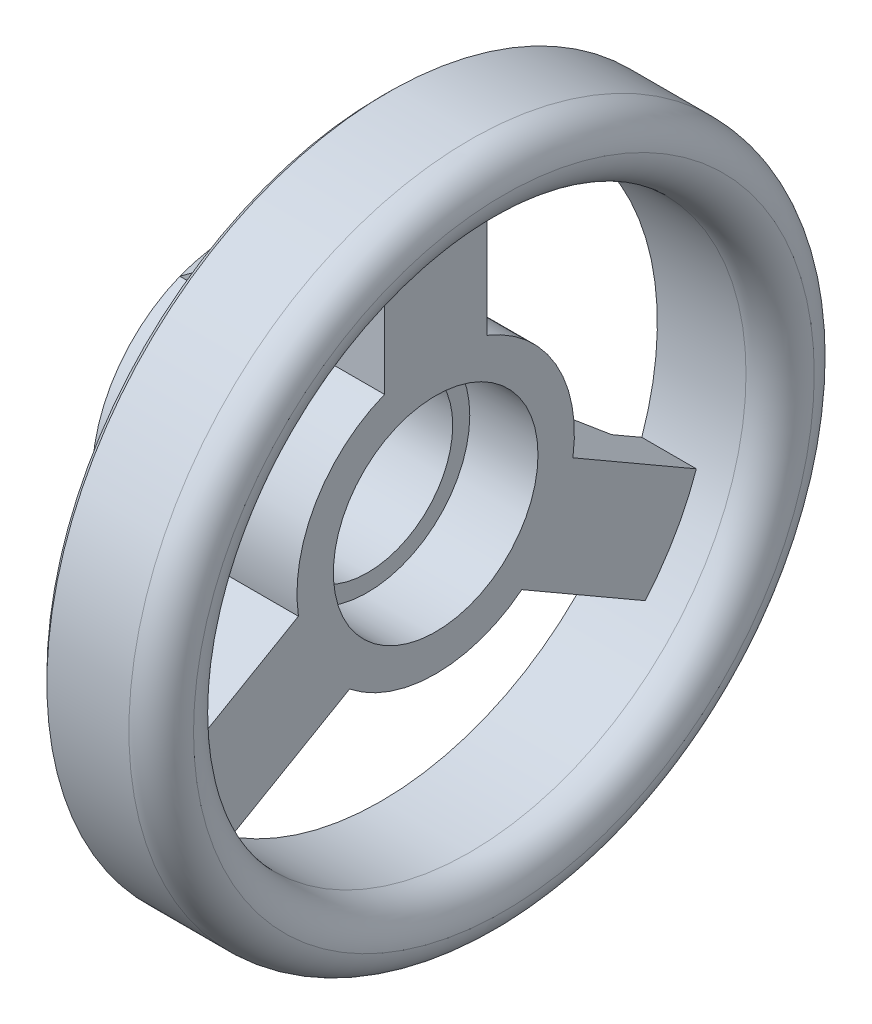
ISO-10303-21;
HEADER;
FILE_DESCRIPTION(('STEP AP214'),'2;1');
FILE_NAME('part.step','',(''),(''),'','','');
FILE_SCHEMA(('AUTOMOTIVE_DESIGN { 1 0 10303 214 1 1 1 1 }'));
ENDSEC;
DATA;
#1=APPLICATION_CONTEXT('core data for automotive mechanical design processes');
#2=APPLICATION_PROTOCOL_DEFINITION('international standard','automotive_design',2000,#1);
#3=PRODUCT_CONTEXT('',#1,'mechanical');
#4=PRODUCT('Part','Part','',(#3));
#5=PRODUCT_RELATED_PRODUCT_CATEGORY('part','',(#4));
#6=PRODUCT_DEFINITION_FORMATION('','',#4);
#7=PRODUCT_DEFINITION_CONTEXT('part definition',#1,'design');
#8=PRODUCT_DEFINITION('design','',#6,#7);
#9=PRODUCT_DEFINITION_SHAPE('','',#8);
#10=(LENGTH_UNIT() NAMED_UNIT(*) SI_UNIT(.MILLI.,.METRE.));
#11=(NAMED_UNIT(*) PLANE_ANGLE_UNIT() SI_UNIT($,.RADIAN.));
#12=(NAMED_UNIT(*) SI_UNIT($,.STERADIAN.) SOLID_ANGLE_UNIT());
#13=UNCERTAINTY_MEASURE_WITH_UNIT(LENGTH_MEASURE(1.E-05),#10,'distance_accuracy_value','');
#14=(GEOMETRIC_REPRESENTATION_CONTEXT(3) GLOBAL_UNCERTAINTY_ASSIGNED_CONTEXT((#13)) GLOBAL_UNIT_ASSIGNED_CONTEXT((#10,
#11,#12)) REPRESENTATION_CONTEXT('',''));
#15=CARTESIAN_POINT('',(0.,0.,0.));
#16=DIRECTION('',(0.,0.,1.));
#17=DIRECTION('',(1.,0.,0.));
#18=AXIS2_PLACEMENT_3D('',#15,#16,#17);
#19=CARTESIAN_POINT('',(2.2,0.,0.));
#20=DIRECTION('',(1.,0.,0.));
#21=DIRECTION('',(0.,0.,-1.));
#22=AXIS2_PLACEMENT_3D('',#19,#20,#21);
#23=CONICAL_SURFACE('',#22,3.55,0.603457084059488);
#24=CARTESIAN_POINT('',(0.,0.,0.));
#25=DIRECTION('',(-1.,0.,0.));
#26=DIRECTION('',(0.,0.,1.));
#27=AXIS2_PLACEMENT_3D('',#24,#25,#26);
#28=CIRCLE('',#27,2.03370718);
#29=CARTESIAN_POINT('',(0.,-1.59469957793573,1.26210068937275));
#30=VERTEX_POINT('',#29);
#31=CARTESIAN_POINT('',(0.,-0.295661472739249,2.01210069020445));
#32=VERTEX_POINT('',#31);
#33=EDGE_CURVE('E163',#30,#32,#28,.T.);
#34=ORIENTED_EDGE('',*,*,#33,.F.);
#35=CARTESIAN_POINT('',(-0.000200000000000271,-1.59462542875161,1.26197225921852));
#36=CARTESIAN_POINT('',(0.0904731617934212,-1.6282361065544,1.32018766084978));
#37=CARTESIAN_POINT('',(0.181366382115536,-1.66169756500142,1.37814460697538));
#38=CARTESIAN_POINT('',(0.363501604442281,-1.72838147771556,1.49364453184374));
#39=CARTESIAN_POINT('',(0.45474360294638,-1.76160393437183,1.55118751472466));
#40=CARTESIAN_POINT('',(0.728852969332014,-1.8610009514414,1.72334819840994));
#41=CARTESIAN_POINT('',(0.912109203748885,-1.92690718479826,1.83750114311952));
#42=CARTESIAN_POINT('',(1.27925745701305,-2.05826996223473,2.06502814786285));
#43=CARTESIAN_POINT('',(1.46314946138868,-2.12372651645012,2.17840222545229));
#44=CARTESIAN_POINT('',(1.83138548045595,-2.25432710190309,2.40460907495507));
#45=CARTESIAN_POINT('',(2.01572950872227,-2.31947112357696,2.51744183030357));
#46=CARTESIAN_POINT('',(2.2002,-2.38452472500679,2.63011797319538));
#47=B_SPLINE_CURVE_WITH_KNOTS('',3,(#35,#36,#37,#38,#39,#40,#41,#42,#43,#44,#45,#46),
.UNSPECIFIED.,.F.,.F.,(4,2,2,2,2,4),(0.,0.338617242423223,0.677231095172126,1.3544383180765,
2.03163022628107,2.7088427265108),.UNSPECIFIED.);
#48=CARTESIAN_POINT('',(2.2,-2.38445421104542,2.62999583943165));
#49=VERTEX_POINT('',#48);
#50=EDGE_CURVE('E495',#30,#49,#47,.T.);
#51=ORIENTED_EDGE('',*,*,#50,.T.);
#52=CARTESIAN_POINT('',(2.2,0.,0.));
#53=DIRECTION('',(-1.,0.,0.));
#54=DIRECTION('',(0.,0.,1.));
#55=AXIS2_PLACEMENT_3D('',#52,#53,#54);
#56=CIRCLE('',#55,3.55);
#57=CARTESIAN_POINT('',(2.2,-1.08541610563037,3.37999583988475));
#58=VERTEX_POINT('',#57);
#59=EDGE_CURVE('E245',#49,#58,#56,.T.);
#60=ORIENTED_EDGE('',*,*,#59,.T.);
#61=CARTESIAN_POINT('',(2.2002,-1.08548661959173,3.38011797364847));
#62=CARTESIAN_POINT('',(2.01572950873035,-1.02043301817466,3.26744183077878));
#63=CARTESIAN_POINT('',(1.83138548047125,-0.955288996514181,3.15460907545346));
#64=CARTESIAN_POINT('',(1.46314946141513,-0.824688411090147,2.9284022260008));
#65=CARTESIAN_POINT('',(1.27925745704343,-0.759231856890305,2.81502814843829));
#66=CARTESIAN_POINT('',(0.912109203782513,-0.627869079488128,2.58750114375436));
#67=CARTESIAN_POINT('',(0.72885296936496,-0.561962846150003,2.47334819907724));
#68=CARTESIAN_POINT('',(0.454743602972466,-0.462565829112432,2.30118751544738));
#69=CARTESIAN_POINT('',(0.363501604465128,-0.429343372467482,2.24364453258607));
#70=CARTESIAN_POINT('',(0.181366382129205,-0.362659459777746,2.12814460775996));
#71=CARTESIAN_POINT('',(0.0904731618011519,-0.3291980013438,2.07018766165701));
#72=CARTESIAN_POINT('',(-0.000199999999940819,-0.295587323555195,2.01197226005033));
#73=B_SPLINE_CURVE_WITH_KNOTS('',3,(#61,#62,#63,#64,#65,#66,#67,#68,#69,#70,#71,#72),
.UNSPECIFIED.,.F.,.F.,(4,2,2,2,2,4),(0.,0.677212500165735,1.3544044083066,2.03161163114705,
2.37022548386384,2.7088427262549),.UNSPECIFIED.);
#74=EDGE_CURVE('E273',#58,#32,#73,.T.);
#75=ORIENTED_EDGE('',*,*,#74,.T.);
#76=EDGE_LOOP('',(#34,#51,#60,#75));
#77=FACE_BOUND('',#76,.T.);
#78=ADVANCED_FACE('F26',(#77),#23,.T.);
#79=CARTESIAN_POINT('',(2.2,-1.08541610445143,-3.37999584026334));
#80=VERTEX_POINT('',#79);
#81=CARTESIAN_POINT('',(2.2,-2.38445421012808,-2.62999584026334));
#82=VERTEX_POINT('',#81);
#83=EDGE_CURVE('E155',#80,#82,#56,.T.);
#84=ORIENTED_EDGE('',*,*,#83,.T.);
#85=CARTESIAN_POINT('',(2.2002,-2.38452472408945,-2.63011797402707));
#86=CARTESIAN_POINT('',(2.01572950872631,-2.319471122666,-2.51744183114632));
#87=CARTESIAN_POINT('',(1.8313854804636,-2.25432710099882,-2.40460907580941));
#88=CARTESIAN_POINT('',(1.4631494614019,-2.12372651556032,-2.17840222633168));
#89=CARTESIAN_POINT('',(1.27925745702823,-2.0582699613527,-2.0650281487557));
#90=CARTESIAN_POINT('',(0.912109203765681,-1.92690718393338,-1.83750114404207));
#91=CARTESIAN_POINT('',(0.728852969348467,-1.86100095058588,-1.72334819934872));
#92=CARTESIAN_POINT('',(0.454743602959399,-1.76160393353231,-1.55118751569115));
#93=CARTESIAN_POINT('',(0.36350160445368,-1.7283814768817,-1.49364453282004));
#94=CARTESIAN_POINT('',(0.181366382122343,-1.66169756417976,-1.3781446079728));
#95=CARTESIAN_POINT('',(0.0904731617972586,-1.62823610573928,-1.32018766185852));
#96=CARTESIAN_POINT('',(-0.000200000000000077,-1.59462542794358,-1.26197226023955));
#97=B_SPLINE_CURVE_WITH_KNOTS('',3,(#85,#86,#87,#88,#89,#90,#91,#92,#93,#94,#95,#96),
.UNSPECIFIED.,.F.,.F.,(4,2,2,2,2,4),(0.,0.677212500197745,1.35440440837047,2.03161163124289,
2.37022548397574,2.70884272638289),.UNSPECIFIED.);
#98=CARTESIAN_POINT('',(0.,-1.59469957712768,-1.26210069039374));
#99=VERTEX_POINT('',#98);
#100=EDGE_CURVE('E41',#82,#99,#97,.T.);
#101=ORIENTED_EDGE('',*,*,#100,.T.);
#102=CARTESIAN_POINT('',(0.,-0.295661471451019,-2.01210069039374));
#103=VERTEX_POINT('',#102);
#104=EDGE_CURVE('E152',#103,#99,#28,.T.);
#105=ORIENTED_EDGE('',*,*,#104,.F.);
#106=CARTESIAN_POINT('',(-0.000199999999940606,-0.295587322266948,-2.01197226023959));
#107=CARTESIAN_POINT('',(0.0904731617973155,-0.329198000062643,-2.07018766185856));
#108=CARTESIAN_POINT('',(0.181366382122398,-0.362659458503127,-2.12814460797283));
#109=CARTESIAN_POINT('',(0.363501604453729,-0.429343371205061,-2.24364453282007));
#110=CARTESIAN_POINT('',(0.454743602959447,-0.462565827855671,-2.30118751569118));
#111=CARTESIAN_POINT('',(0.728852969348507,-0.561962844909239,-2.47334819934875));
#112=CARTESIAN_POINT('',(0.912109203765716,-0.627869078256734,-2.5875011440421));
#113=CARTESIAN_POINT('',(1.27925745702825,-0.759231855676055,-2.81502814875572));
#114=CARTESIAN_POINT('',(1.46314946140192,-0.824688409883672,-2.9284022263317));
#115=CARTESIAN_POINT('',(1.83138548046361,-0.955288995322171,-3.15460907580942));
#116=CARTESIAN_POINT('',(2.01572950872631,-1.02043301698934,-3.26744183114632));
#117=CARTESIAN_POINT('',(2.2002,-1.08548661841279,-3.38011797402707));
#118=B_SPLINE_CURVE_WITH_KNOTS('',3,(#106,#107,#108,#109,#110,#111,#112,#113,#114,#115,#116,
#117),.UNSPECIFIED.,.F.,.F.,(4,2,2,2,2,4),(0.,0.338617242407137,0.677231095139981,
1.35443831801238,2.03163022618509,2.70884272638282),.UNSPECIFIED.);
#119=EDGE_CURVE('E444',#103,#80,#118,.T.);
#120=ORIENTED_EDGE('',*,*,#119,.T.);
#121=EDGE_LOOP('',(#84,#101,#105,#120));
#122=FACE_BOUND('',#121,.T.);
#123=ADVANCED_FACE('F150',(#122),#23,.T.);
#124=CARTESIAN_POINT('',(4.,0.,0.));
#125=DIRECTION('',(-1.,0.,0.));
#126=DIRECTION('',(0.,0.,1.));
#127=AXIS2_PLACEMENT_3D('',#124,#125,#126);
#128=CYLINDRICAL_SURFACE('',#127,1.25);
#129=CARTESIAN_POINT('',(0.,0.,0.));
#130=DIRECTION('',(-1.,0.,0.));
#131=DIRECTION('',(0.,0.,1.));
#132=AXIS2_PLACEMENT_3D('',#129,#130,#131);
#133=CIRCLE('',#132,1.25);
#134=CARTESIAN_POINT('',(0.,0.,1.25));
#135=VERTEX_POINT('',#134);
#136=EDGE_CURVE('E182',#135,#135,#133,.T.);
#137=ORIENTED_EDGE('',*,*,#136,.T.);
#138=EDGE_LOOP('',(#137));
#139=FACE_BOUND('',#138,.T.);
#140=CARTESIAN_POINT('',(2.,0.,0.));
#141=DIRECTION('',(1.,0.,0.));
#142=DIRECTION('',(0.,0.,-1.));
#143=AXIS2_PLACEMENT_3D('',#140,#141,#142);
#144=CIRCLE('',#143,1.25);
#145=CARTESIAN_POINT('',(2.,0.,-1.25));
#146=VERTEX_POINT('',#145);
#147=EDGE_CURVE('E179',#146,#146,#144,.F.);
#148=ORIENTED_EDGE('',*,*,#147,.F.);
#149=EDGE_LOOP('',(#148));
#150=FACE_BOUND('',#149,.T.);
#151=ADVANCED_FACE('F224',(#139,#150),#128,.F.);
#152=CARTESIAN_POINT('',(0.,2.03370718,0.));
#153=DIRECTION('',(1.,0.,0.));
#154=DIRECTION('',(0.,0.,-1.));
#155=AXIS2_PLACEMENT_3D('',#152,#153,#154);
#156=PLANE('',#155);
#157=ORIENTED_EDGE('',*,*,#136,.F.);
#158=EDGE_LOOP('',(#157));
#159=FACE_BOUND('',#158,.T.);
#160=CARTESIAN_POINT('',(0.,1.8903610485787,0.75));
#161=VERTEX_POINT('',#160);
#162=CARTESIAN_POINT('',(0.,1.8903610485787,-0.75));
#163=VERTEX_POINT('',#162);
#164=EDGE_CURVE('E162',#161,#163,#28,.T.);
#165=ORIENTED_EDGE('',*,*,#164,.T.);
#166=CARTESIAN_POINT('',(0.,-2.09264593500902E-09,3.62456917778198E-09));
#167=DIRECTION('',(-1.,0.,0.));
#168=DIRECTION('',(0.,0.,1.));
#169=AXIS2_PLACEMENT_3D('',#166,#167,#168);
#170=CIRCLE('',#169,2.03370718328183);
#171=EDGE_CURVE('E161',#163,#103,#170,.T.);
#172=ORIENTED_EDGE('',*,*,#171,.T.);
#173=ORIENTED_EDGE('',*,*,#104,.T.);
#174=CARTESIAN_POINT('',(0.,4.18529230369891E-09,0.));
#175=DIRECTION('',(-1.,0.,0.));
#176=DIRECTION('',(0.,0.,1.));
#177=AXIS2_PLACEMENT_3D('',#174,#175,#176);
#178=CIRCLE('',#177,2.03370718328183);
#179=EDGE_CURVE('E140',#99,#30,#178,.T.);
#180=ORIENTED_EDGE('',*,*,#179,.T.);
#181=ORIENTED_EDGE('',*,*,#33,.T.);
#182=CARTESIAN_POINT('',(0.,-2.09263986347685E-09,-3.62455833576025E-09));
#183=DIRECTION('',(-1.,0.,0.));
#184=DIRECTION('',(0.,0.,-1.));
#185=AXIS2_PLACEMENT_3D('',#182,#183,#184);
#186=CIRCLE('',#185,2.03370718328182);
#187=EDGE_CURVE('E437',#32,#161,#186,.T.);
#188=ORIENTED_EDGE('',*,*,#187,.T.);
#189=EDGE_LOOP('',(#165,#172,#173,#180,#181,#188));
#190=FACE_BOUND('',#189,.T.);
#191=ADVANCED_FACE('F28',(#159,#190),#156,.F.);
#192=CARTESIAN_POINT('',(2.2,3.4698703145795,0.75));
#193=VERTEX_POINT('',#192);
#194=CARTESIAN_POINT('',(2.2,3.4698703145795,-0.75));
#195=VERTEX_POINT('',#194);
#196=EDGE_CURVE('E166',#193,#195,#56,.T.);
#197=ORIENTED_EDGE('',*,*,#196,.T.);
#198=CARTESIAN_POINT('',(-1.06176039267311,1.06418343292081,-0.75));
#199=CARTESIAN_POINT('',(-1.00400408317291,1.11284376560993,-0.75));
#200=CARTESIAN_POINT('',(-0.94574693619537,1.16089954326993,-0.75));
#201=CARTESIAN_POINT('',(-0.828464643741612,1.25605404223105,-0.75));
#202=CARTESIAN_POINT('',(-0.769439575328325,1.30315285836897,-0.75));
#203=CARTESIAN_POINT('',(-0.650857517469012,1.39664404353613,-0.75));
#204=CARTESIAN_POINT('',(-0.591300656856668,1.44303657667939,-0.75));
#205=CARTESIAN_POINT('',(-0.471767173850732,1.53528074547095,-0.75));
#206=CARTESIAN_POINT('',(-0.411790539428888,1.58113236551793,-0.75));
#207=CARTESIAN_POINT('',(-0.231426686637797,1.71802350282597,-0.75));
#208=CARTESIAN_POINT('',(-0.110561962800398,1.80843332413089,-0.75));
#209=CARTESIAN_POINT('',(0.131982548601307,1.98816735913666,-0.75));
#210=CARTESIAN_POINT('',(0.253662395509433,2.07749149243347,-0.75));
#211=CARTESIAN_POINT('',(0.572550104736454,2.31008261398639,-0.75));
#212=CARTESIAN_POINT('',(0.770196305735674,2.45274811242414,-0.75));
#213=CARTESIAN_POINT('',(1.16630834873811,2.73692267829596,-0.75));
#214=CARTESIAN_POINT('',(1.36477417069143,2.8784317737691,-0.75));
#215=CARTESIAN_POINT('',(1.76229362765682,3.16073657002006,-0.75));
#216=CARTESIAN_POINT('',(1.96134740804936,3.30153206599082,-0.75));
#217=CARTESIAN_POINT('',(2.35981772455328,3.58260890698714,-0.75));
#218=CARTESIAN_POINT('',(2.55923426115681,3.72289025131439,-0.75));
#219=CARTESIAN_POINT('',(3.1157273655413,4.11360537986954,-0.749999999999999));
#220=CARTESIAN_POINT('',(3.47308375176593,4.36364050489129,-0.749999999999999));
#221=CARTESIAN_POINT('',(4.18827104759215,4.86302954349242,-0.749999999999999));
#222=CARTESIAN_POINT('',(4.54610195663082,5.11238345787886,-0.749999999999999));
#223=CARTESIAN_POINT('',(5.26186763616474,5.61051162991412,-0.749999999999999));
#224=CARTESIAN_POINT('',(5.61980223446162,5.8592861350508,-0.749999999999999));
#225=CARTESIAN_POINT('',(6.33588554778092,6.35652608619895,-0.749999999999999));
#226=CARTESIAN_POINT('',(6.69403426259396,6.60499153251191,-0.749999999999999));
#227=CARTESIAN_POINT('',(7.05224480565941,6.85336753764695,-0.749999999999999));
#228=B_SPLINE_CURVE_WITH_KNOTS('',3,(#198,#199,#200,#201,#202,#203,#204,#205,#206,#207,#208,
#209,#210,#211,#212,#213,#214,#215,#216,#217,#218,#219,#220,#221,#222,#223,#224,#225,#226,#227),
.UNSPECIFIED.,.F.,.F.,(4,2,2,2,2,2,2,2,2,2,2,2,2,2,4),(0.,0.226553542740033,0.453084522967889,
0.679562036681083,0.906046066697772,1.35884832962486,1.81168392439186,2.5429463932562,
3.27419107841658,4.00563493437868,4.7370797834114,6.04550865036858,7.35393596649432,
8.66162585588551,9.96931446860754),.UNSPECIFIED.);
#229=EDGE_CURVE('E241',#195,#163,#228,.F.);
#230=ORIENTED_EDGE('',*,*,#229,.T.);
#231=ORIENTED_EDGE('',*,*,#164,.F.);
#232=CARTESIAN_POINT('',(-1.06176039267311,1.06418343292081,0.75));
#233=CARTESIAN_POINT('',(-1.00400408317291,1.11284376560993,0.75));
#234=CARTESIAN_POINT('',(-0.945746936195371,1.16089954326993,0.75));
#235=CARTESIAN_POINT('',(-0.828464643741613,1.25605404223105,0.75));
#236=CARTESIAN_POINT('',(-0.769439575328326,1.30315285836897,0.75));
#237=CARTESIAN_POINT('',(-0.650857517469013,1.39664404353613,0.75));
#238=CARTESIAN_POINT('',(-0.591300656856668,1.44303657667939,0.75));
#239=CARTESIAN_POINT('',(-0.471767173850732,1.53528074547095,0.75));
#240=CARTESIAN_POINT('',(-0.411790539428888,1.58113236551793,0.75));
#241=CARTESIAN_POINT('',(-0.231426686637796,1.71802350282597,0.75));
#242=CARTESIAN_POINT('',(-0.110561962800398,1.80843332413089,0.75));
#243=CARTESIAN_POINT('',(0.131982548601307,1.98816735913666,0.75));
#244=CARTESIAN_POINT('',(0.253662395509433,2.07749149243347,0.75));
#245=CARTESIAN_POINT('',(0.572550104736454,2.31008261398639,0.75));
#246=CARTESIAN_POINT('',(0.770196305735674,2.45274811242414,0.75));
#247=CARTESIAN_POINT('',(1.16630834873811,2.73692267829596,0.75));
#248=CARTESIAN_POINT('',(1.36477417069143,2.8784317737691,0.75));
#249=CARTESIAN_POINT('',(1.76229362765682,3.16073657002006,0.75));
#250=CARTESIAN_POINT('',(1.96134740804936,3.30153206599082,0.75));
#251=CARTESIAN_POINT('',(2.35981772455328,3.58260890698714,0.75));
#252=CARTESIAN_POINT('',(2.55923426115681,3.72289025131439,0.75));
#253=CARTESIAN_POINT('',(3.1157273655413,4.11360537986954,0.75));
#254=CARTESIAN_POINT('',(3.47308375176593,4.36364050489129,0.75));
#255=CARTESIAN_POINT('',(4.18827104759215,4.86302954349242,0.75));
#256=CARTESIAN_POINT('',(4.54610195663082,5.11238345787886,0.75));
#257=CARTESIAN_POINT('',(5.26186763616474,5.61051162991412,0.75));
#258=CARTESIAN_POINT('',(5.61980223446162,5.8592861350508,0.75));
#259=CARTESIAN_POINT('',(6.33588554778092,6.35652608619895,0.75));
#260=CARTESIAN_POINT('',(6.69403426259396,6.60499153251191,0.75));
#261=CARTESIAN_POINT('',(7.05224480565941,6.85336753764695,0.75));
#262=B_SPLINE_CURVE_WITH_KNOTS('',3,(#232,#233,#234,#235,#236,#237,#238,#239,#240,#241,#242,
#243,#244,#245,#246,#247,#248,#249,#250,#251,#252,#253,#254,#255,#256,#257,#258,#259,#260,#261),
.UNSPECIFIED.,.F.,.F.,(4,2,2,2,2,2,2,2,2,2,2,2,2,2,4),(0.,0.226553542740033,0.453084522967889,
0.679562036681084,0.906046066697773,1.35884832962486,1.81168392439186,2.54294639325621,
3.27419107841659,4.00563493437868,4.7370797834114,6.04550865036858,7.35393596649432,
8.66162585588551,9.96931446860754),.UNSPECIFIED.);
#263=EDGE_CURVE('E242',#161,#193,#262,.T.);
#264=ORIENTED_EDGE('',*,*,#263,.T.);
#265=EDGE_LOOP('',(#197,#230,#231,#264));
#266=FACE_BOUND('',#265,.T.);
#267=ADVANCED_FACE('F219',(#266),#23,.T.);
#268=CARTESIAN_POINT('',(2.2,5.,0.));
#269=DIRECTION('',(1.,0.,0.));
#270=DIRECTION('',(0.,0.,-1.));
#271=AXIS2_PLACEMENT_3D('',#268,#269,#270);
#272=PLANE('',#271);
#273=CARTESIAN_POINT('',(2.2,0.,0.));
#274=DIRECTION('',(1.,0.,0.));
#275=DIRECTION('',(0.,0.,-1.));
#276=AXIS2_PLACEMENT_3D('',#273,#274,#275);
#277=CIRCLE('',#276,4.9);
#278=CARTESIAN_POINT('',(2.2,0.,-4.9));
#279=VERTEX_POINT('',#278);
#280=EDGE_CURVE('E34',#279,#279,#277,.F.);
#281=ORIENTED_EDGE('',*,*,#280,.T.);
#282=EDGE_LOOP('',(#281));
#283=FACE_BOUND('',#282,.T.);
#284=ORIENTED_EDGE('',*,*,#59,.F.);
#285=DIRECTION('',(0.,-0.500000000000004,0.866025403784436));
#286=VECTOR('',#285,1.);
#287=CARTESIAN_POINT('',(2.2,0.600480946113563,-2.54006351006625));
#288=LINE('',#287,#286);
#289=CARTESIAN_POINT('',(2.2,-2.63949392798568,3.07173758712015));
#290=VERTEX_POINT('',#289);
#291=EDGE_CURVE('E156',#49,#290,#288,.T.);
#292=ORIENTED_EDGE('',*,*,#291,.T.);
#293=CARTESIAN_POINT('',(2.2,0.,0.));
#294=DIRECTION('',(1.,0.,0.));
#295=DIRECTION('',(0.,0.,-1.));
#296=AXIS2_PLACEMENT_3D('',#293,#294,#295);
#297=CIRCLE('',#296,4.05);
#298=CARTESIAN_POINT('',(2.2,-2.63949392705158,-3.07173758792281));
#299=VERTEX_POINT('',#298);
#300=EDGE_CURVE('E509',#290,#299,#297,.T.);
#301=ORIENTED_EDGE('',*,*,#300,.T.);
#302=DIRECTION('',(0.,0.500000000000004,0.866025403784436));
#303=VECTOR('',#302,1.);
#304=CARTESIAN_POINT('',(2.2,0.600480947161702,2.54006350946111));
#305=LINE('',#304,#303);
#306=EDGE_CURVE('E157',#299,#82,#305,.T.);
#307=ORIENTED_EDGE('',*,*,#306,.T.);
#308=ORIENTED_EDGE('',*,*,#83,.F.);
#309=DIRECTION('',(0.,-0.500000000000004,-0.866025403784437));
#310=VECTOR('',#309,1.);
#311=CARTESIAN_POINT('',(2.2,1.89951905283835,1.7900635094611));
#312=LINE('',#311,#310);
#313=CARTESIAN_POINT('',(2.2,-1.34045582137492,-3.82173758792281));
#314=VERTEX_POINT('',#313);
#315=EDGE_CURVE('E447',#80,#314,#312,.T.);
#316=ORIENTED_EDGE('',*,*,#315,.T.);
#317=CARTESIAN_POINT('',(2.2,0.,0.));
#318=DIRECTION('',(1.,0.,0.));
#319=DIRECTION('',(0.,0.,-1.));
#320=AXIS2_PLACEMENT_3D('',#317,#318,#319);
#321=CIRCLE('',#320,4.05000000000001);
#322=CARTESIAN_POINT('',(2.2,3.97994974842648,-0.75));
#323=VERTEX_POINT('',#322);
#324=EDGE_CURVE('E472',#314,#323,#321,.T.);
#325=ORIENTED_EDGE('',*,*,#324,.T.);
#326=DIRECTION('',(0.,-1.,0.));
#327=VECTOR('',#326,1.);
#328=CARTESIAN_POINT('',(2.2,5.,-0.749999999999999));
#329=LINE('',#328,#327);
#330=EDGE_CURVE('E473',#323,#195,#329,.T.);
#331=ORIENTED_EDGE('',*,*,#330,.T.);
#332=ORIENTED_EDGE('',*,*,#196,.F.);
#333=DIRECTION('',(0.,1.,0.));
#334=VECTOR('',#333,1.);
#335=CARTESIAN_POINT('',(2.2,5.,0.75));
#336=LINE('',#335,#334);
#337=CARTESIAN_POINT('',(2.2,3.97994974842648,0.75));
#338=VERTEX_POINT('',#337);
#339=EDGE_CURVE('E458',#193,#338,#336,.T.);
#340=ORIENTED_EDGE('',*,*,#339,.T.);
#341=CARTESIAN_POINT('',(2.2,0.,0.));
#342=DIRECTION('',(1.,0.,0.));
#343=DIRECTION('',(0.,0.,-1.));
#344=AXIS2_PLACEMENT_3D('',#341,#342,#343);
#345=CIRCLE('',#344,4.05);
#346=CARTESIAN_POINT('',(2.2,-1.3404558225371,3.82173758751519));
#347=VERTEX_POINT('',#346);
#348=EDGE_CURVE('E463',#338,#347,#345,.T.);
#349=ORIENTED_EDGE('',*,*,#348,.T.);
#350=DIRECTION('',(0.,0.500000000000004,-0.866025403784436));
#351=VECTOR('',#350,1.);
#352=CARTESIAN_POINT('',(2.2,1.89951905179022,-1.79006351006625));
#353=LINE('',#352,#351);
#354=EDGE_CURVE('E279',#347,#58,#353,.T.);
#355=ORIENTED_EDGE('',*,*,#354,.T.);
#356=EDGE_LOOP('',(#284,#292,#301,#307,#308,#316,#325,#331,#332,#340,#349,#355));
#357=FACE_BOUND('',#356,.T.);
#358=ADVANCED_FACE('F203',(#283,#357),#272,.F.);
#359=CARTESIAN_POINT('',(0.,0.,0.));
#360=DIRECTION('',(-1.,0.,0.));
#361=DIRECTION('',(0.,0.,1.));
#362=AXIS2_PLACEMENT_3D('',#359,#360,#361);
#363=CYLINDRICAL_SURFACE('',#362,5.);
#364=CARTESIAN_POINT('',(2.3,0.,0.));
#365=DIRECTION('',(1.,0.,0.));
#366=DIRECTION('',(0.,0.,-1.));
#367=AXIS2_PLACEMENT_3D('',#364,#365,#366);
#368=CIRCLE('',#367,5.);
#369=CARTESIAN_POINT('',(2.3,0.,-5.));
#370=VERTEX_POINT('',#369);
#371=EDGE_CURVE('E11',#370,#370,#368,.T.);
#372=ORIENTED_EDGE('',*,*,#371,.T.);
#373=EDGE_LOOP('',(#372));
#374=FACE_BOUND('',#373,.T.);
#375=CARTESIAN_POINT('',(3.50250628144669,0.,0.));
#376=DIRECTION('',(1.,0.,0.));
#377=DIRECTION('',(0.,0.,-1.));
#378=AXIS2_PLACEMENT_3D('',#375,#376,#377);
#379=CIRCLE('',#378,5.);
#380=CARTESIAN_POINT('',(3.50250628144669,0.,-5.));
#381=VERTEX_POINT('',#380);
#382=EDGE_CURVE('E175',#381,#381,#379,.F.);
#383=ORIENTED_EDGE('',*,*,#382,.T.);
#384=EDGE_LOOP('',(#383));
#385=FACE_BOUND('',#384,.T.);
#386=ADVANCED_FACE('F234',(#374,#385),#363,.T.);
#387=CARTESIAN_POINT('',(0.,0.,0.));
#388=DIRECTION('',(-1.,0.,0.));
#389=DIRECTION('',(0.,0.,1.));
#390=AXIS2_PLACEMENT_3D('',#387,#388,#389);
#391=CYLINDRICAL_SURFACE('',#390,4.05);
#392=DIRECTION('',(1.,0.,0.));
#393=VECTOR('',#392,1.);
#394=CARTESIAN_POINT('',(0.,-2.63949392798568,3.07173758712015));
#395=LINE('',#394,#393);
#396=CARTESIAN_POINT('',(3.,-2.63949392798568,3.07173758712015));
#397=VERTEX_POINT('',#396);
#398=EDGE_CURVE('E512',#290,#397,#395,.T.);
#399=ORIENTED_EDGE('',*,*,#398,.T.);
#400=CARTESIAN_POINT('',(3.,0.,0.));
#401=DIRECTION('',(-1.,0.,0.));
#402=DIRECTION('',(0.,0.,1.));
#403=AXIS2_PLACEMENT_3D('',#400,#401,#402);
#404=CIRCLE('',#403,4.05);
#405=CARTESIAN_POINT('',(3.,-1.3404558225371,3.82173758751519));
#406=VERTEX_POINT('',#405);
#407=EDGE_CURVE('E253',#397,#406,#404,.T.);
#408=ORIENTED_EDGE('',*,*,#407,.T.);
#409=DIRECTION('',(1.,0.,0.));
#410=VECTOR('',#409,1.);
#411=CARTESIAN_POINT('',(0.,-1.3404558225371,3.82173758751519));
#412=LINE('',#411,#410);
#413=EDGE_CURVE('E443',#347,#406,#412,.T.);
#414=ORIENTED_EDGE('',*,*,#413,.F.);
#415=ORIENTED_EDGE('',*,*,#348,.F.);
#416=DIRECTION('',(1.,0.,0.));
#417=VECTOR('',#416,1.);
#418=CARTESIAN_POINT('',(0.,3.97994974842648,0.75));
#419=LINE('',#418,#417);
#420=CARTESIAN_POINT('',(3.,3.97994974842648,0.75));
#421=VERTEX_POINT('',#420);
#422=EDGE_CURVE('E439',#338,#421,#419,.T.);
#423=ORIENTED_EDGE('',*,*,#422,.T.);
#424=CARTESIAN_POINT('',(3.,3.97994974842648,-0.75));
#425=VERTEX_POINT('',#424);
#426=EDGE_CURVE('E246',#421,#425,#404,.T.);
#427=ORIENTED_EDGE('',*,*,#426,.T.);
#428=DIRECTION('',(1.,0.,0.));
#429=VECTOR('',#428,1.);
#430=CARTESIAN_POINT('',(0.,3.97994974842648,-0.75));
#431=LINE('',#430,#429);
#432=EDGE_CURVE('E494',#323,#425,#431,.T.);
#433=ORIENTED_EDGE('',*,*,#432,.F.);
#434=ORIENTED_EDGE('',*,*,#324,.F.);
#435=DIRECTION('',(1.,0.,0.));
#436=VECTOR('',#435,1.);
#437=CARTESIAN_POINT('',(0.,-1.34045582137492,-3.82173758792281));
#438=LINE('',#437,#436);
#439=CARTESIAN_POINT('',(3.,-1.34045582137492,-3.82173758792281));
#440=VERTEX_POINT('',#439);
#441=EDGE_CURVE('E481',#314,#440,#438,.T.);
#442=ORIENTED_EDGE('',*,*,#441,.T.);
#443=CARTESIAN_POINT('',(3.,-2.63949392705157,-3.07173758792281));
#444=VERTEX_POINT('',#443);
#445=EDGE_CURVE('E252',#440,#444,#404,.T.);
#446=ORIENTED_EDGE('',*,*,#445,.T.);
#447=DIRECTION('',(1.,0.,0.));
#448=VECTOR('',#447,1.);
#449=CARTESIAN_POINT('',(0.,-2.63949392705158,-3.07173758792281));
#450=LINE('',#449,#448);
#451=EDGE_CURVE('E47',#299,#444,#450,.T.);
#452=ORIENTED_EDGE('',*,*,#451,.F.);
#453=ORIENTED_EDGE('',*,*,#300,.F.);
#454=EDGE_LOOP('',(#399,#408,#414,#415,#423,#427,#433,#434,#442,#446,#452,#453));
#455=FACE_BOUND('',#454,.T.);
#456=CARTESIAN_POINT('',(3.5,0.,0.));
#457=DIRECTION('',(-1.,0.,0.));
#458=DIRECTION('',(0.,0.,1.));
#459=AXIS2_PLACEMENT_3D('',#456,#457,#458);
#460=CIRCLE('',#459,4.05);
#461=CARTESIAN_POINT('',(3.5,0.,4.05));
#462=VERTEX_POINT('',#461);
#463=EDGE_CURVE('E172',#462,#462,#460,.F.);
#464=ORIENTED_EDGE('',*,*,#463,.T.);
#465=EDGE_LOOP('',(#464));
#466=FACE_BOUND('',#465,.T.);
#467=ADVANCED_FACE('F310',(#455,#466),#391,.F.);
#468=CARTESIAN_POINT('',(3.,4.05,0.));
#469=DIRECTION('',(-1.,0.,0.));
#470=DIRECTION('',(0.,0.,1.));
#471=AXIS2_PLACEMENT_3D('',#468,#469,#470);
#472=PLANE('',#471);
#473=CARTESIAN_POINT('',(3.,0.,0.));
#474=DIRECTION('',(1.,0.,0.));
#475=DIRECTION('',(0.,0.,-1.));
#476=AXIS2_PLACEMENT_3D('',#473,#474,#475);
#477=CIRCLE('',#476,1.5);
#478=CARTESIAN_POINT('',(3.,0.,-1.5));
#479=VERTEX_POINT('',#478);
#480=EDGE_CURVE('E270',#479,#479,#477,.T.);
#481=ORIENTED_EDGE('',*,*,#480,.F.);
#482=EDGE_LOOP('',(#481));
#483=FACE_BOUND('',#482,.T.);
#484=ORIENTED_EDGE('',*,*,#407,.F.);
#485=DIRECTION('',(0.,0.500000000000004,-0.866025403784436));
#486=VECTOR('',#485,1.);
#487=CARTESIAN_POINT('',(3.,0.362980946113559,-2.12870144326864));
#488=LINE('',#487,#486);
#489=CARTESIAN_POINT('',(3.,-1.59469957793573,1.26210068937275));
#490=VERTEX_POINT('',#489);
#491=EDGE_CURVE('E198',#397,#490,#488,.T.);
#492=ORIENTED_EDGE('',*,*,#491,.T.);
#493=CARTESIAN_POINT('',(3.,4.18529230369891E-09,0.));
#494=DIRECTION('',(-1.,0.,0.));
#495=DIRECTION('',(0.,0.,1.));
#496=AXIS2_PLACEMENT_3D('',#493,#494,#495);
#497=CIRCLE('',#496,2.03370718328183);
#498=CARTESIAN_POINT('',(3.,-1.59469957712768,-1.26210069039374));
#499=VERTEX_POINT('',#498);
#500=EDGE_CURVE('E196',#490,#499,#497,.F.);
#501=ORIENTED_EDGE('',*,*,#500,.T.);
#502=DIRECTION('',(0.,-0.500000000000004,-0.866025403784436));
#503=VECTOR('',#502,1.);
#504=CARTESIAN_POINT('',(3.,0.362980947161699,2.1287014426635));
#505=LINE('',#504,#503);
#506=EDGE_CURVE('E133',#499,#444,#505,.T.);
#507=ORIENTED_EDGE('',*,*,#506,.T.);
#508=ORIENTED_EDGE('',*,*,#445,.F.);
#509=DIRECTION('',(0.,0.500000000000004,0.866025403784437));
#510=VECTOR('',#509,1.);
#511=CARTESIAN_POINT('',(3.,1.66201905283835,1.37870144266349));
#512=LINE('',#511,#510);
#513=CARTESIAN_POINT('',(3.,-0.295661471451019,-2.01210069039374));
#514=VERTEX_POINT('',#513);
#515=EDGE_CURVE('E192',#440,#514,#512,.T.);
#516=ORIENTED_EDGE('',*,*,#515,.T.);
#517=CARTESIAN_POINT('',(3.,-2.09264593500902E-09,3.62456917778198E-09));
#518=DIRECTION('',(-1.,0.,0.));
#519=DIRECTION('',(0.,0.,1.));
#520=AXIS2_PLACEMENT_3D('',#517,#518,#519);
#521=CIRCLE('',#520,2.03370718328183);
#522=CARTESIAN_POINT('',(3.,1.8903610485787,-0.75));
#523=VERTEX_POINT('',#522);
#524=EDGE_CURVE('E189',#514,#523,#521,.F.);
#525=ORIENTED_EDGE('',*,*,#524,.T.);
#526=DIRECTION('',(0.,1.,0.));
#527=VECTOR('',#526,1.);
#528=CARTESIAN_POINT('',(3.,4.05,-0.75));
#529=LINE('',#528,#527);
#530=EDGE_CURVE('E483',#523,#425,#529,.T.);
#531=ORIENTED_EDGE('',*,*,#530,.T.);
#532=ORIENTED_EDGE('',*,*,#426,.F.);
#533=DIRECTION('',(0.,-1.,0.));
#534=VECTOR('',#533,1.);
#535=CARTESIAN_POINT('',(3.,4.05,0.75));
#536=LINE('',#535,#534);
#537=CARTESIAN_POINT('',(3.,1.8903610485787,0.75));
#538=VERTEX_POINT('',#537);
#539=EDGE_CURVE('E454',#421,#538,#536,.T.);
#540=ORIENTED_EDGE('',*,*,#539,.T.);
#541=CARTESIAN_POINT('',(3.,-2.09263986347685E-09,-3.62455833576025E-09));
#542=DIRECTION('',(-1.,0.,0.));
#543=DIRECTION('',(0.,0.,1.));
#544=AXIS2_PLACEMENT_3D('',#541,#542,#543);
#545=CIRCLE('',#544,2.03370718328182);
#546=CARTESIAN_POINT('',(3.,-0.295661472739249,2.01210069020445));
#547=VERTEX_POINT('',#546);
#548=EDGE_CURVE('E186',#538,#547,#545,.F.);
#549=ORIENTED_EDGE('',*,*,#548,.T.);
#550=DIRECTION('',(0.,-0.500000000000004,0.866025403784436));
#551=VECTOR('',#550,1.);
#552=CARTESIAN_POINT('',(3.,1.66201905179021,-1.37870144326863));
#553=LINE('',#552,#551);
#554=EDGE_CURVE('E178',#547,#406,#553,.T.);
#555=ORIENTED_EDGE('',*,*,#554,.T.);
#556=EDGE_LOOP('',(#484,#492,#501,#507,#508,#516,#525,#531,#532,#540,#549,#555));
#557=FACE_BOUND('',#556,.T.);
#558=ADVANCED_FACE('F306',(#483,#557),#472,.F.);
#559=CARTESIAN_POINT('',(3.5,0.,0.));
#560=DIRECTION('',(-1.,0.,0.));
#561=DIRECTION('',(0.,0.,1.));
#562=AXIS2_PLACEMENT_3D('',#559,#560,#561);
#563=TOROIDAL_SURFACE('',#562,4.55,0.5);
#564=ORIENTED_EDGE('',*,*,#463,.F.);
#565=EDGE_LOOP('',(#564));
#566=FACE_BOUND('',#565,.T.);
#567=CARTESIAN_POINT('',(4.,0.,0.));
#568=DIRECTION('',(-1.,0.,0.));
#569=DIRECTION('',(0.,0.,1.));
#570=AXIS2_PLACEMENT_3D('',#567,#568,#569);
#571=CIRCLE('',#570,4.55);
#572=CARTESIAN_POINT('',(4.,0.,4.55));
#573=VERTEX_POINT('',#572);
#574=EDGE_CURVE('E165',#573,#573,#571,.T.);
#575=ORIENTED_EDGE('',*,*,#574,.F.);
#576=EDGE_LOOP('',(#575));
#577=FACE_BOUND('',#576,.T.);
#578=ADVANCED_FACE('F302',(#566,#577),#563,.T.);
#579=CARTESIAN_POINT('',(3.50250628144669,0.,0.));
#580=DIRECTION('',(1.,0.,0.));
#581=DIRECTION('',(0.,0.,-1.));
#582=AXIS2_PLACEMENT_3D('',#579,#580,#581);
#583=TOROIDAL_SURFACE('',#582,4.5,0.5);
#584=ORIENTED_EDGE('',*,*,#574,.T.);
#585=EDGE_LOOP('',(#584));
#586=FACE_BOUND('',#585,.T.);
#587=ORIENTED_EDGE('',*,*,#382,.F.);
#588=EDGE_LOOP('',(#587));
#589=FACE_BOUND('',#588,.T.);
#590=ADVANCED_FACE('F294',(#586,#589),#583,.T.);
#591=CARTESIAN_POINT('',(2.,0.,0.));
#592=DIRECTION('',(1.,0.,0.));
#593=DIRECTION('',(0.,0.,-1.));
#594=AXIS2_PLACEMENT_3D('',#591,#592,#593);
#595=PLANE('',#594);
#596=CARTESIAN_POINT('',(2.,0.,0.));
#597=DIRECTION('',(1.,0.,0.));
#598=DIRECTION('',(0.,0.,-1.));
#599=AXIS2_PLACEMENT_3D('',#596,#597,#598);
#600=CIRCLE('',#599,1.5);
#601=CARTESIAN_POINT('',(2.,0.,-1.5));
#602=VERTEX_POINT('',#601);
#603=EDGE_CURVE('E183',#602,#602,#600,.T.);
#604=ORIENTED_EDGE('',*,*,#603,.T.);
#605=EDGE_LOOP('',(#604));
#606=FACE_BOUND('',#605,.T.);
#607=ORIENTED_EDGE('',*,*,#147,.T.);
#608=EDGE_LOOP('',(#607));
#609=FACE_BOUND('',#608,.T.);
#610=ADVANCED_FACE('F290',(#606,#609),#595,.T.);
#611=CARTESIAN_POINT('',(2.,0.,0.));
#612=DIRECTION('',(1.,0.,0.));
#613=DIRECTION('',(0.,0.,-1.));
#614=AXIS2_PLACEMENT_3D('',#611,#612,#613);
#615=CYLINDRICAL_SURFACE('',#614,1.5);
#616=ORIENTED_EDGE('',*,*,#603,.F.);
#617=EDGE_LOOP('',(#616));
#618=FACE_BOUND('',#617,.T.);
#619=ORIENTED_EDGE('',*,*,#480,.T.);
#620=EDGE_LOOP('',(#619));
#621=FACE_BOUND('',#620,.T.);
#622=ADVANCED_FACE('F293',(#618,#621),#615,.F.);
#623=CARTESIAN_POINT('',(0.,-2.09263986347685E-09,-3.62455833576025E-09));
#624=DIRECTION('',(1.,0.,0.));
#625=DIRECTION('',(0.,0.,-1.));
#626=AXIS2_PLACEMENT_3D('',#623,#624,#625);
#627=CYLINDRICAL_SURFACE('',#626,2.03370718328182);
#628=DIRECTION('',(1.,0.,0.));
#629=VECTOR('',#628,1.);
#630=CARTESIAN_POINT('',(0.,1.8903610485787,0.75));
#631=LINE('',#630,#629);
#632=EDGE_CURVE('E434',#161,#538,#631,.T.);
#633=ORIENTED_EDGE('',*,*,#632,.F.);
#634=ORIENTED_EDGE('',*,*,#187,.F.);
#635=DIRECTION('',(1.,0.,0.));
#636=VECTOR('',#635,1.);
#637=CARTESIAN_POINT('',(0.,-0.295661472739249,2.01210069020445));
#638=LINE('',#637,#636);
#639=EDGE_CURVE('E440',#32,#547,#638,.T.);
#640=ORIENTED_EDGE('',*,*,#639,.T.);
#641=ORIENTED_EDGE('',*,*,#548,.F.);
#642=EDGE_LOOP('',(#633,#634,#640,#641));
#643=FACE_BOUND('',#642,.T.);
#644=ADVANCED_FACE('F287',(#643),#627,.T.);
#645=CARTESIAN_POINT('',(0.,-1.3404558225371,3.82173758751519));
#646=DIRECTION('',(0.,-0.866025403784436,-0.500000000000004));
#647=DIRECTION('',(0.,0.500000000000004,-0.866025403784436));
#648=AXIS2_PLACEMENT_3D('',#645,#646,#647);
#649=PLANE('',#648);
#650=ORIENTED_EDGE('',*,*,#354,.F.);
#651=ORIENTED_EDGE('',*,*,#413,.T.);
#652=ORIENTED_EDGE('',*,*,#554,.F.);
#653=ORIENTED_EDGE('',*,*,#639,.F.);
#654=ORIENTED_EDGE('',*,*,#74,.F.);
#655=EDGE_LOOP('',(#650,#651,#652,#653,#654));
#656=FACE_BOUND('',#655,.T.);
#657=ADVANCED_FACE('F281',(#656),#649,.F.);
#658=CARTESIAN_POINT('',(0.,3.97994974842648,0.75));
#659=DIRECTION('',(0.,0.,-1.));
#660=DIRECTION('',(-1.,0.,0.));
#661=AXIS2_PLACEMENT_3D('',#658,#659,#660);
#662=PLANE('',#661);
#663=ORIENTED_EDGE('',*,*,#632,.T.);
#664=ORIENTED_EDGE('',*,*,#539,.F.);
#665=ORIENTED_EDGE('',*,*,#422,.F.);
#666=ORIENTED_EDGE('',*,*,#339,.F.);
#667=ORIENTED_EDGE('',*,*,#263,.F.);
#668=EDGE_LOOP('',(#663,#664,#665,#666,#667));
#669=FACE_BOUND('',#668,.T.);
#670=ADVANCED_FACE('F286',(#669),#662,.F.);
#671=CARTESIAN_POINT('',(0.,-1.34045582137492,-3.82173758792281));
#672=DIRECTION('',(0.,-0.866025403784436,0.500000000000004));
#673=DIRECTION('',(0.,-0.500000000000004,-0.866025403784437));
#674=AXIS2_PLACEMENT_3D('',#671,#672,#673);
#675=PLANE('',#674);
#676=DIRECTION('',(1.,0.,0.));
#677=VECTOR('',#676,1.);
#678=CARTESIAN_POINT('',(0.,-0.295661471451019,-2.01210069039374));
#679=LINE('',#678,#677);
#680=EDGE_CURVE('E484',#103,#514,#679,.T.);
#681=ORIENTED_EDGE('',*,*,#680,.T.);
#682=ORIENTED_EDGE('',*,*,#515,.F.);
#683=ORIENTED_EDGE('',*,*,#441,.F.);
#684=ORIENTED_EDGE('',*,*,#315,.F.);
#685=ORIENTED_EDGE('',*,*,#119,.F.);
#686=EDGE_LOOP('',(#681,#682,#683,#684,#685));
#687=FACE_BOUND('',#686,.T.);
#688=ADVANCED_FACE('F356',(#687),#675,.F.);
#689=CARTESIAN_POINT('',(0.,-2.09264593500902E-09,3.62456917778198E-09));
#690=DIRECTION('',(1.,0.,0.));
#691=DIRECTION('',(0.,0.,-1.));
#692=AXIS2_PLACEMENT_3D('',#689,#690,#691);
#693=CYLINDRICAL_SURFACE('',#692,2.03370718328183);
#694=ORIENTED_EDGE('',*,*,#680,.F.);
#695=ORIENTED_EDGE('',*,*,#171,.F.);
#696=DIRECTION('',(1.,0.,0.));
#697=VECTOR('',#696,1.);
#698=CARTESIAN_POINT('',(0.,1.8903610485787,-0.75));
#699=LINE('',#698,#697);
#700=EDGE_CURVE('E487',#163,#523,#699,.T.);
#701=ORIENTED_EDGE('',*,*,#700,.T.);
#702=ORIENTED_EDGE('',*,*,#524,.F.);
#703=EDGE_LOOP('',(#694,#695,#701,#702));
#704=FACE_BOUND('',#703,.T.);
#705=ADVANCED_FACE('F348',(#704),#693,.T.);
#706=CARTESIAN_POINT('',(0.,3.97994974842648,-0.75));
#707=DIRECTION('',(0.,0.,1.));
#708=DIRECTION('',(0.,-1.,0.));
#709=AXIS2_PLACEMENT_3D('',#706,#707,#708);
#710=PLANE('',#709);
#711=ORIENTED_EDGE('',*,*,#330,.F.);
#712=ORIENTED_EDGE('',*,*,#432,.T.);
#713=ORIENTED_EDGE('',*,*,#530,.F.);
#714=ORIENTED_EDGE('',*,*,#700,.F.);
#715=ORIENTED_EDGE('',*,*,#229,.F.);
#716=EDGE_LOOP('',(#711,#712,#713,#714,#715));
#717=FACE_BOUND('',#716,.T.);
#718=ADVANCED_FACE('F341',(#717),#710,.F.);
#719=CARTESIAN_POINT('',(0.,-2.63949392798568,3.07173758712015));
#720=DIRECTION('',(0.,0.866025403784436,0.500000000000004));
#721=DIRECTION('',(0.,-0.500000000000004,0.866025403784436));
#722=AXIS2_PLACEMENT_3D('',#719,#720,#721);
#723=PLANE('',#722);
#724=DIRECTION('',(1.,0.,0.));
#725=VECTOR('',#724,1.);
#726=CARTESIAN_POINT('',(0.,-1.59469957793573,1.26210068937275));
#727=LINE('',#726,#725);
#728=EDGE_CURVE('E136',#30,#490,#727,.T.);
#729=ORIENTED_EDGE('',*,*,#728,.T.);
#730=ORIENTED_EDGE('',*,*,#491,.F.);
#731=ORIENTED_EDGE('',*,*,#398,.F.);
#732=ORIENTED_EDGE('',*,*,#291,.F.);
#733=ORIENTED_EDGE('',*,*,#50,.F.);
#734=EDGE_LOOP('',(#729,#730,#731,#732,#733));
#735=FACE_BOUND('',#734,.T.);
#736=ADVANCED_FACE('F334',(#735),#723,.F.);
#737=CARTESIAN_POINT('',(0.,4.18529230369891E-09,0.));
#738=DIRECTION('',(1.,0.,0.));
#739=DIRECTION('',(0.,0.,-1.));
#740=AXIS2_PLACEMENT_3D('',#737,#738,#739);
#741=CYLINDRICAL_SURFACE('',#740,2.03370718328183);
#742=ORIENTED_EDGE('',*,*,#728,.F.);
#743=ORIENTED_EDGE('',*,*,#179,.F.);
#744=DIRECTION('',(1.,0.,0.));
#745=VECTOR('',#744,1.);
#746=CARTESIAN_POINT('',(0.,-1.59469957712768,-1.26210069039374));
#747=LINE('',#746,#745);
#748=EDGE_CURVE('E130',#99,#499,#747,.T.);
#749=ORIENTED_EDGE('',*,*,#748,.T.);
#750=ORIENTED_EDGE('',*,*,#500,.F.);
#751=EDGE_LOOP('',(#742,#743,#749,#750));
#752=FACE_BOUND('',#751,.T.);
#753=ADVANCED_FACE('F141',(#752),#741,.T.);
#754=CARTESIAN_POINT('',(0.,-2.63949392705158,-3.07173758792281));
#755=DIRECTION('',(0.,0.866025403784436,-0.500000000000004));
#756=DIRECTION('',(0.,0.500000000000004,0.866025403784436));
#757=AXIS2_PLACEMENT_3D('',#754,#755,#756);
#758=PLANE('',#757);
#759=ORIENTED_EDGE('',*,*,#306,.F.);
#760=ORIENTED_EDGE('',*,*,#451,.T.);
#761=ORIENTED_EDGE('',*,*,#506,.F.);
#762=ORIENTED_EDGE('',*,*,#748,.F.);
#763=ORIENTED_EDGE('',*,*,#100,.F.);
#764=EDGE_LOOP('',(#759,#760,#761,#762,#763));
#765=FACE_BOUND('',#764,.T.);
#766=ADVANCED_FACE('F132',(#765),#758,.F.);
#767=CARTESIAN_POINT('',(2.2,0.,0.));
#768=DIRECTION('',(1.,0.,0.));
#769=DIRECTION('',(0.,0.,-1.));
#770=AXIS2_PLACEMENT_3D('',#767,#768,#769);
#771=CONICAL_SURFACE('',#770,4.9,0.785398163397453);
#772=CARTESIAN_POINT('',(2.3,0.,-5.));
#773=CARTESIAN_POINT('',(2.29895833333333,0.,-4.99895833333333));
#774=CARTESIAN_POINT('',(2.29791666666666,0.,-4.99791666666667));
#775=CARTESIAN_POINT('',(2.29583333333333,0.,-4.99583333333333));
#776=CARTESIAN_POINT('',(2.29479166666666,0.,-4.99479166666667));
#777=CARTESIAN_POINT('',(2.29270833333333,0.,-4.99270833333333));
#778=CARTESIAN_POINT('',(2.29166666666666,0.,-4.99166666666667));
#779=CARTESIAN_POINT('',(2.28958333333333,0.,-4.98958333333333));
#780=CARTESIAN_POINT('',(2.28854166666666,0.,-4.98854166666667));
#781=CARTESIAN_POINT('',(2.28645833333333,0.,-4.98645833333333));
#782=CARTESIAN_POINT('',(2.28541666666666,0.,-4.98541666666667));
#783=CARTESIAN_POINT('',(2.28333333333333,0.,-4.98333333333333));
#784=CARTESIAN_POINT('',(2.28229166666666,0.,-4.98229166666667));
#785=CARTESIAN_POINT('',(2.28020833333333,0.,-4.98020833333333));
#786=CARTESIAN_POINT('',(2.27916666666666,0.,-4.97916666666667));
#787=CARTESIAN_POINT('',(2.27708333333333,0.,-4.97708333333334));
#788=CARTESIAN_POINT('',(2.27604166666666,0.,-4.97604166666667));
#789=CARTESIAN_POINT('',(2.27395833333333,0.,-4.97395833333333));
#790=CARTESIAN_POINT('',(2.27291666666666,0.,-4.97291666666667));
#791=CARTESIAN_POINT('',(2.27083333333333,0.,-4.97083333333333));
#792=CARTESIAN_POINT('',(2.26979166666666,0.,-4.96979166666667));
#793=CARTESIAN_POINT('',(2.26770833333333,0.,-4.96770833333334));
#794=CARTESIAN_POINT('',(2.26666666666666,0.,-4.96666666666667));
#795=CARTESIAN_POINT('',(2.26458333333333,0.,-4.96458333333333));
#796=CARTESIAN_POINT('',(2.26354166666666,0.,-4.96354166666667));
#797=CARTESIAN_POINT('',(2.26145833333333,0.,-4.96145833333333));
#798=CARTESIAN_POINT('',(2.26041666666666,0.,-4.96041666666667));
#799=CARTESIAN_POINT('',(2.25833333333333,0.,-4.95833333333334));
#800=CARTESIAN_POINT('',(2.25729166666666,0.,-4.95729166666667));
#801=CARTESIAN_POINT('',(2.25520833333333,0.,-4.95520833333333));
#802=CARTESIAN_POINT('',(2.25416666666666,0.,-4.95416666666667));
#803=CARTESIAN_POINT('',(2.25208333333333,0.,-4.95208333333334));
#804=CARTESIAN_POINT('',(2.25104166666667,0.,-4.95104166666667));
#805=CARTESIAN_POINT('',(2.24895833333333,0.,-4.94895833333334));
#806=CARTESIAN_POINT('',(2.24791666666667,0.,-4.94791666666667));
#807=CARTESIAN_POINT('',(2.24583333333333,0.,-4.94583333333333));
#808=CARTESIAN_POINT('',(2.24479166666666,0.,-4.94479166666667));
#809=CARTESIAN_POINT('',(2.24270833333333,0.,-4.94270833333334));
#810=CARTESIAN_POINT('',(2.24166666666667,0.,-4.94166666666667));
#811=CARTESIAN_POINT('',(2.23958333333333,0.,-4.93958333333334));
#812=CARTESIAN_POINT('',(2.23854166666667,0.,-4.93854166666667));
#813=CARTESIAN_POINT('',(2.23645833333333,0.,-4.93645833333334));
#814=CARTESIAN_POINT('',(2.23541666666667,0.,-4.93541666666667));
#815=CARTESIAN_POINT('',(2.23333333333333,0.,-4.93333333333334));
#816=CARTESIAN_POINT('',(2.23229166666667,0.,-4.93229166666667));
#817=CARTESIAN_POINT('',(2.23020833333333,0.,-4.93020833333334));
#818=CARTESIAN_POINT('',(2.22916666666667,0.,-4.92916666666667));
#819=CARTESIAN_POINT('',(2.22708333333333,0.,-4.92708333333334));
#820=CARTESIAN_POINT('',(2.22604166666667,0.,-4.92604166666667));
#821=CARTESIAN_POINT('',(2.22395833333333,0.,-4.92395833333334));
#822=CARTESIAN_POINT('',(2.22291666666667,0.,-4.92291666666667));
#823=CARTESIAN_POINT('',(2.22083333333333,0.,-4.92083333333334));
#824=CARTESIAN_POINT('',(2.21979166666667,0.,-4.91979166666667));
#825=CARTESIAN_POINT('',(2.21770833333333,0.,-4.91770833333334));
#826=CARTESIAN_POINT('',(2.21666666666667,0.,-4.91666666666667));
#827=CARTESIAN_POINT('',(2.21458333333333,0.,-4.91458333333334));
#828=CARTESIAN_POINT('',(2.21354166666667,0.,-4.91354166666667));
#829=CARTESIAN_POINT('',(2.21145833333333,0.,-4.91145833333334));
#830=CARTESIAN_POINT('',(2.21041666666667,0.,-4.91041666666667));
#831=CARTESIAN_POINT('',(2.20833333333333,0.,-4.90833333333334));
#832=CARTESIAN_POINT('',(2.20729166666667,0.,-4.90729166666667));
#833=CARTESIAN_POINT('',(2.20520833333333,0.,-4.90520833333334));
#834=CARTESIAN_POINT('',(2.20416666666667,0.,-4.90416666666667));
#835=CARTESIAN_POINT('',(2.20208333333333,0.,-4.90208333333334));
#836=CARTESIAN_POINT('',(2.20104166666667,0.,-4.90104166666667));
#837=CARTESIAN_POINT('',(2.2,0.,-4.9));
#838=B_SPLINE_CURVE_WITH_KNOTS('',3,(#772,#773,#774,#775,#776,#777,#778,#779,#780,#781,#782,
#783,#784,#785,#786,#787,#788,#789,#790,#791,#792,#793,#794,#795,#796,#797,#798,#799,#800,#801,
#802,#803,#804,#805,#806,#807,#808,#809,#810,#811,#812,#813,#814,#815,#816,#817,#818,#819,#820,
#821,#822,#823,#824,#825,#826,#827,#828,#829,#830,#831,#832,#833,#834,#835,#836,#837),
.UNSPECIFIED.,.F.,.F.,(4,2,2,2,2,2,2,2,2,2,2,2,2,2,2,2,2,2,2,2,2,2,2,2,2,2,2,2,2,2,2,2,4),(0.,
0.00441941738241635,0.0088388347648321,0.0132582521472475,0.0176776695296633,0.0220970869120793,
0.0265165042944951,0.0309359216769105,0.0353553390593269,0.0397747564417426,0.044194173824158,
0.0486135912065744,0.0530330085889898,0.0574524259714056,0.0618718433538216,0.0662912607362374,
0.0707106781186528,0.0751300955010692,0.0795495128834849,0.0839689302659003,0.0883883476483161,
0.0928077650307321,0.0972271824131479,0.101646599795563,0.10606601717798,0.110485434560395,
0.114904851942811,0.119324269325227,0.123743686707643,0.128163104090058,0.132582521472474,
0.13700193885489,0.141421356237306),.UNSPECIFIED.);
#839=EDGE_CURVE('BSEAM206',#370,#279,#838,.T.);
#840=ORIENTED_EDGE('',*,*,#371,.F.);
#841=ORIENTED_EDGE('',*,*,#280,.F.);
#842=ORIENTED_EDGE('',*,*,#839,.T.);
#843=ORIENTED_EDGE('',*,*,#839,.F.);
#844=EDGE_LOOP('',(#840,#842,#841,#843));
#845=FACE_BOUND('',#844,.T.);
#846=ADVANCED_FACE('F206',(#845),#771,.T.);
#847=CLOSED_SHELL('',(#78,#123,#151,#191,#267,#358,#386,#467,#558,#578,#590,#610,#622,#644,#657,
#670,#688,#705,#718,#736,#753,#766,#846));
#848=MANIFOLD_SOLID_BREP('B2',#847);
#849=ADVANCED_BREP_SHAPE_REPRESENTATION('',(#18,#848),#14);
#850=SHAPE_DEFINITION_REPRESENTATION(#9,#849);
ENDSEC;
END-ISO-10303-21;
